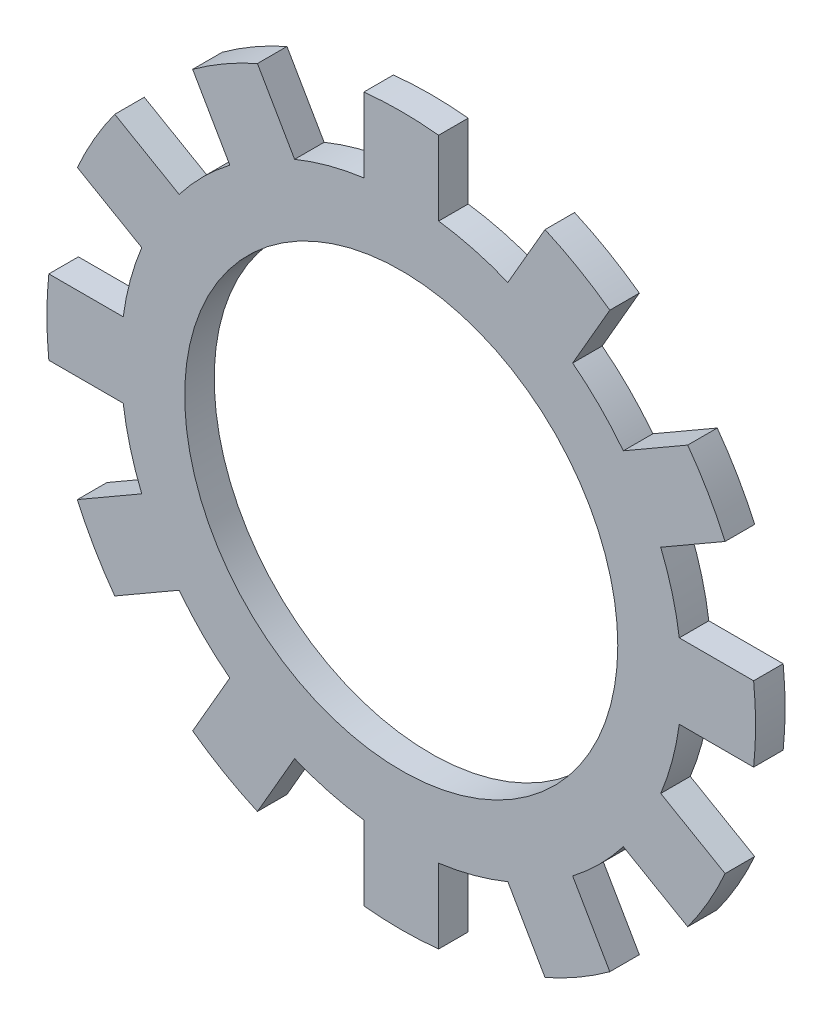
from build123d import *

# Parameters (mm, degrees)
SKETCH1_R                 = 14.25
SKETCH1_R_2               = 11
BOSS_EXTRUDE1_DEPTH       = 0.75
BOSS_EXTRUDE2_DEPTH       = 0.75
CIRPATTERN2_COUNT         = 12
CIRPATTERN2_COPY_1_DEPTH  = 0.75
CIRPATTERN2_COPY_2_DEPTH  = 0.75
CIRPATTERN2_COPY_3_DEPTH  = 0.75
CIRPATTERN2_COPY_4_DEPTH  = 0.75
CIRPATTERN2_COPY_5_DEPTH  = 0.75
CIRPATTERN2_COPY_6_DEPTH  = 0.75
CIRPATTERN2_COPY_7_DEPTH  = 0.75
CIRPATTERN2_COPY_8_DEPTH  = 0.75
CIRPATTERN2_COPY_9_DEPTH  = 0.75
CIRPATTERN2_COPY_10_DEPTH = 0.75
CIRPATTERN2_COPY_11_DEPTH = 0.75


with BuildPart() as part:
    # Sketch1 → Boss-Extrude1 (new, symmetric)
    with BuildSketch(Plane.XY):
        Circle(SKETCH1_R)
        Circle(SKETCH1_R_2, mode=Mode.SUBTRACT)
    extrude(amount=BOSS_EXTRUDE1_DEPTH, both=True)

    # Sketch3 → Boss-Extrude2 (add, symmetric)
    with BuildSketch(Plane.XY):
        with BuildLine():
            Line((-1.9, 17.899441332), (-1.9, 14.12276531))
            ThreePointArc((-1.9, 14.12276531), (-0.952127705, 14.218155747), (0, 14.25))
            Line((0, 14.25), (0, 18))
            ThreePointArc((0, 18), (-0.951329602, 17.974842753), (-1.9, 17.899441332))
        make_face()
    boss_extrude2 = extrude(amount=BOSS_EXTRUDE2_DEPTH, both=True)

    # Mirror1: Boss-Extrude2 across plane
    add(boss_extrude2.mirror(Plane(origin=(0, 0, 0), x_dir=(0, 0, 1), z_dir=(1, 0, 0))))

    # CirPattern2: Boss-Extrude2 ×12 about axis
    cirpattern2_axis = Axis((0, 0, 0), (0, 0, 1))
    for i in range(1, CIRPATTERN2_COUNT):
        add(boss_extrude2.rotate(cirpattern2_axis, i * 360 / CIRPATTERN2_COUNT))

    # CirPattern2 copy 1 sketch → CirPattern2 copy 1 (add, symmetric)
    with BuildSketch(Plane(origin=(0, 0, 0), x_dir=(-0.8660254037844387, -0.49999999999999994, 0), z_dir=(0, 0, 1))):
        with BuildLine():
            Line((-1.9, -17.899441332), (-1.9, -14.12276531))
            ThreePointArc((-1.9, -14.12276531), (-0.952127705, -14.218155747), (0, -14.25))
            Line((0, -14.25), (0, -18))
            ThreePointArc((0, -18), (-0.951329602, -17.974842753), (-1.9, -17.899441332))
        make_face()
    extrude(amount=CIRPATTERN2_COPY_1_DEPTH, both=True)

    # CirPattern2 copy 2 sketch → CirPattern2 copy 2 (add, symmetric)
    with BuildSketch(Plane(origin=(0, 0, 0), x_dir=(-0.5000000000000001, -0.8660254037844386, 0), z_dir=(0, 0, 1))):
        with BuildLine():
            Line((-1.9, -17.899441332), (-1.9, -14.12276531))
            ThreePointArc((-1.9, -14.12276531), (-0.952127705, -14.218155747), (0, -14.25))
            Line((0, -14.25), (0, -18))
            ThreePointArc((0, -18), (-0.951329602, -17.974842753), (-1.9, -17.899441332))
        make_face()
    extrude(amount=CIRPATTERN2_COPY_2_DEPTH, both=True)

    # CirPattern2 copy 3 sketch → CirPattern2 copy 3 (add, symmetric)
    with BuildSketch(Plane(origin=(0, 0, 0), x_dir=(0, -1, 0), z_dir=(0, 0, 1))):
        with BuildLine():
            Line((-1.9, -17.899441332), (-1.9, -14.12276531))
            ThreePointArc((-1.9, -14.12276531), (-0.952127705, -14.218155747), (0, -14.25))
            Line((0, -14.25), (0, -18))
            ThreePointArc((0, -18), (-0.951329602, -17.974842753), (-1.9, -17.899441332))
        make_face()
    extrude(amount=CIRPATTERN2_COPY_3_DEPTH, both=True)

    # CirPattern2 copy 4 sketch → CirPattern2 copy 4 (add, symmetric)
    with BuildSketch(Plane(origin=(0, 0, 0), x_dir=(0.4999999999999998, -0.8660254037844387, 0), z_dir=(0, 0, 1))):
        with BuildLine():
            Line((-1.9, -17.899441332), (-1.9, -14.12276531))
            ThreePointArc((-1.9, -14.12276531), (-0.952127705, -14.218155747), (0, -14.25))
            Line((0, -14.25), (0, -18))
            ThreePointArc((0, -18), (-0.951329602, -17.974842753), (-1.9, -17.899441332))
        make_face()
    extrude(amount=CIRPATTERN2_COPY_4_DEPTH, both=True)

    # CirPattern2 copy 5 sketch → CirPattern2 copy 5 (add, symmetric)
    with BuildSketch(Plane(origin=(0, 0, 0), x_dir=(0.8660254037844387, -0.49999999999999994, 0), z_dir=(0, 0, 1))):
        with BuildLine():
            Line((-1.9, -17.899441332), (-1.9, -14.12276531))
            ThreePointArc((-1.9, -14.12276531), (-0.952127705, -14.218155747), (0, -14.25))
            Line((0, -14.25), (0, -18))
            ThreePointArc((0, -18), (-0.951329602, -17.974842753), (-1.9, -17.899441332))
        make_face()
    extrude(amount=CIRPATTERN2_COPY_5_DEPTH, both=True)

    # CirPattern2 copy 6 sketch → CirPattern2 copy 6 (add, symmetric)
    with BuildSketch(Plane.XY):
        with BuildLine():
            Line((-1.9, -17.899441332), (-1.9, -14.12276531))
            ThreePointArc((-1.9, -14.12276531), (-0.952127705, -14.218155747), (0, -14.25))
            Line((0, -14.25), (0, -18))
            ThreePointArc((0, -18), (-0.951329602, -17.974842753), (-1.9, -17.899441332))
        make_face()
    extrude(amount=CIRPATTERN2_COPY_6_DEPTH, both=True)

    # CirPattern2 copy 7 sketch → CirPattern2 copy 7 (add, symmetric)
    with BuildSketch(Plane(origin=(0, 0, 0), x_dir=(0.8660254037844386, 0.5000000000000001, 0), z_dir=(0, 0, 1))):
        with BuildLine():
            Line((-1.9, -17.899441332), (-1.9, -14.12276531))
            ThreePointArc((-1.9, -14.12276531), (-0.952127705, -14.218155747), (0, -14.25))
            Line((0, -14.25), (0, -18))
            ThreePointArc((0, -18), (-0.951329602, -17.974842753), (-1.9, -17.899441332))
        make_face()
    extrude(amount=CIRPATTERN2_COPY_7_DEPTH, both=True)

    # CirPattern2 copy 8 sketch → CirPattern2 copy 8 (add, symmetric)
    with BuildSketch(Plane(origin=(0, 0, 0), x_dir=(0.5000000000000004, 0.8660254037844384, 0), z_dir=(0, 0, 1))):
        with BuildLine():
            Line((-1.9, -17.899441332), (-1.9, -14.12276531))
            ThreePointArc((-1.9, -14.12276531), (-0.952127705, -14.218155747), (0, -14.25))
            Line((0, -14.25), (0, -18))
            ThreePointArc((0, -18), (-0.951329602, -17.974842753), (-1.9, -17.899441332))
        make_face()
    extrude(amount=CIRPATTERN2_COPY_8_DEPTH, both=True)

    # CirPattern2 copy 9 sketch → CirPattern2 copy 9 (add, symmetric)
    with BuildSketch(Plane(origin=(0, 0, 0), x_dir=(0, 1, 0), z_dir=(0, 0, 1))):
        with BuildLine():
            Line((-1.9, -17.899441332), (-1.9, -14.12276531))
            ThreePointArc((-1.9, -14.12276531), (-0.952127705, -14.218155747), (0, -14.25))
            Line((0, -14.25), (0, -18))
            ThreePointArc((0, -18), (-0.951329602, -17.974842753), (-1.9, -17.899441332))
        make_face()
    extrude(amount=CIRPATTERN2_COPY_9_DEPTH, both=True)

    # CirPattern2 copy 10 sketch → CirPattern2 copy 10 (add, symmetric)
    with BuildSketch(Plane(origin=(0, 0, 0), x_dir=(-0.5000000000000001, 0.8660254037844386, 0), z_dir=(0, 0, 1))):
        with BuildLine():
            Line((-1.9, -17.899441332), (-1.9, -14.12276531))
            ThreePointArc((-1.9, -14.12276531), (-0.952127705, -14.218155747), (0, -14.25))
            Line((0, -14.25), (0, -18))
            ThreePointArc((0, -18), (-0.951329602, -17.974842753), (-1.9, -17.899441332))
        make_face()
    extrude(amount=CIRPATTERN2_COPY_10_DEPTH, both=True)

    # CirPattern2 copy 11 sketch → CirPattern2 copy 11 (add, symmetric)
    with BuildSketch(Plane(origin=(0, 0, 0), x_dir=(-0.8660254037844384, 0.5000000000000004, 0), z_dir=(0, 0, 1))):
        with BuildLine():
            Line((-1.9, -17.899441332), (-1.9, -14.12276531))
            ThreePointArc((-1.9, -14.12276531), (-0.952127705, -14.218155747), (0, -14.25))
            Line((0, -14.25), (0, -18))
            ThreePointArc((0, -18), (-0.951329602, -17.974842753), (-1.9, -17.899441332))
        make_face()
    extrude(amount=CIRPATTERN2_COPY_11_DEPTH, both=True)


solid = part.part
